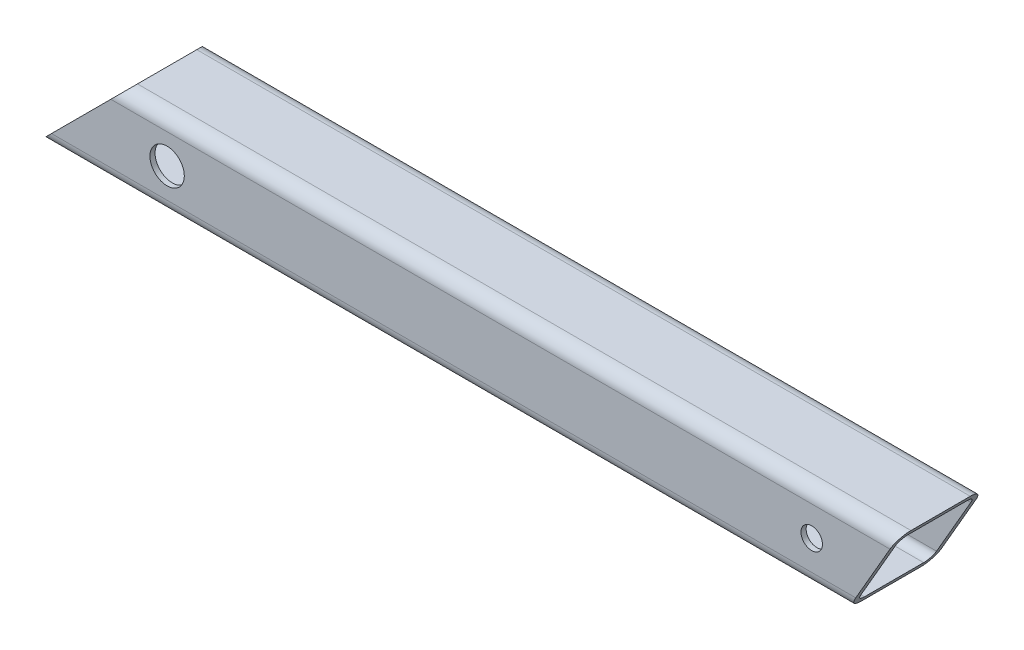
ISO-10303-21;
HEADER;
FILE_DESCRIPTION(('STEP AP214'),'2;1');
FILE_NAME('part.step','',(''),(''),'','','');
FILE_SCHEMA(('AUTOMOTIVE_DESIGN { 1 0 10303 214 1 1 1 1 }'));
ENDSEC;
DATA;
#1=APPLICATION_CONTEXT('core data for automotive mechanical design processes');
#2=APPLICATION_PROTOCOL_DEFINITION('international standard','automotive_design',2000,#1);
#3=PRODUCT_CONTEXT('',#1,'mechanical');
#4=PRODUCT('Part','Part','',(#3));
#5=PRODUCT_RELATED_PRODUCT_CATEGORY('part','',(#4));
#6=PRODUCT_DEFINITION_FORMATION('','',#4);
#7=PRODUCT_DEFINITION_CONTEXT('part definition',#1,'design');
#8=PRODUCT_DEFINITION('design','',#6,#7);
#9=PRODUCT_DEFINITION_SHAPE('','',#8);
#10=(LENGTH_UNIT() NAMED_UNIT(*) SI_UNIT(.MILLI.,.METRE.));
#11=(NAMED_UNIT(*) PLANE_ANGLE_UNIT() SI_UNIT($,.RADIAN.));
#12=(NAMED_UNIT(*) SI_UNIT($,.STERADIAN.) SOLID_ANGLE_UNIT());
#13=UNCERTAINTY_MEASURE_WITH_UNIT(LENGTH_MEASURE(1.E-05),#10,'distance_accuracy_value','');
#14=(GEOMETRIC_REPRESENTATION_CONTEXT(3) GLOBAL_UNCERTAINTY_ASSIGNED_CONTEXT((#13)) GLOBAL_UNIT_ASSIGNED_CONTEXT((#10,
#11,#12)) REPRESENTATION_CONTEXT('',''));
#15=CARTESIAN_POINT('',(0.,0.,0.));
#16=DIRECTION('',(0.,0.,1.));
#17=DIRECTION('',(1.,0.,0.));
#18=AXIS2_PLACEMENT_3D('',#15,#16,#17);
#19=CARTESIAN_POINT('',(1000.,34.5,34.4999999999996));
#20=DIRECTION('',(-1.,0.,0.));
#21=DIRECTION('',(0.,0.,1.));
#22=AXIS2_PLACEMENT_3D('',#19,#20,#21);
#23=CYLINDRICAL_SURFACE('',#22,9.5);
#24=DIRECTION('',(-1.,0.,0.));
#25=VECTOR('',#24,1.);
#26=CARTESIAN_POINT('',(1000.,44.,34.4999999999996));
#27=LINE('',#26,#25);
#28=CARTESIAN_POINT('',(996.535898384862,44.,34.5));
#29=VERTEX_POINT('',#28);
#30=CARTESIAN_POINT('',(93.9999999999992,44.,34.5));
#31=VERTEX_POINT('',#30);
#32=EDGE_CURVE('E12',#29,#31,#27,.T.);
#33=ORIENTED_EDGE('',*,*,#32,.F.);
#34=CARTESIAN_POINT('',(991.051070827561,34.5,34.4999999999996));
#35=DIRECTION('',(0.866025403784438,-0.500000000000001,0.));
#36=DIRECTION('',(-0.500000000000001,-0.866025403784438,0.));
#37=AXIS2_PLACEMENT_3D('',#34,#35,#36);
#38=ELLIPSE('',#37,10.9696551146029,9.5);
#39=CARTESIAN_POINT('',(991.051070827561,34.5,43.9999999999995));
#40=VERTEX_POINT('',#39);
#41=EDGE_CURVE('E278',#29,#40,#38,.T.);
#42=ORIENTED_EDGE('',*,*,#41,.T.);
#43=DIRECTION('',(-1.,0.,0.));
#44=VECTOR('',#43,1.);
#45=CARTESIAN_POINT('',(1000.,34.5,43.9999999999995));
#46=LINE('',#45,#44);
#47=CARTESIAN_POINT('',(84.4999999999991,34.5,44.));
#48=VERTEX_POINT('',#47);
#49=EDGE_CURVE('E214',#40,#48,#46,.T.);
#50=ORIENTED_EDGE('',*,*,#49,.T.);
#51=CARTESIAN_POINT('',(84.4999999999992,34.5,34.5));
#52=DIRECTION('',(-0.707106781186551,0.707106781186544,0.));
#53=DIRECTION('',(-0.707106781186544,-0.707106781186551,0.));
#54=AXIS2_PLACEMENT_3D('',#51,#52,#53);
#55=ELLIPSE('',#54,13.4350288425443,9.5);
#56=EDGE_CURVE('E311',#48,#31,#55,.T.);
#57=ORIENTED_EDGE('',*,*,#56,.T.);
#58=EDGE_LOOP('',(#33,#42,#50,#57));
#59=FACE_BOUND('',#58,.T.);
#60=ADVANCED_FACE('F66',(#59),#23,.F.);
#61=CARTESIAN_POINT('',(1000.,44.,34.4999999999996));
#62=DIRECTION('',(0.,-1.,0.));
#63=DIRECTION('',(0.,0.,-1.));
#64=AXIS2_PLACEMENT_3D('',#61,#62,#63);
#65=PLANE('',#64);
#66=DIRECTION('',(-1.,0.,0.));
#67=VECTOR('',#66,1.);
#68=CARTESIAN_POINT('',(1000.,44.,-34.5000000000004));
#69=LINE('',#68,#67);
#70=CARTESIAN_POINT('',(996.535898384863,44.,-34.5000000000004));
#71=VERTEX_POINT('',#70);
#72=CARTESIAN_POINT('',(93.9999999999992,44.,-34.5));
#73=VERTEX_POINT('',#72);
#74=EDGE_CURVE('E75',#71,#73,#69,.T.);
#75=ORIENTED_EDGE('',*,*,#74,.F.);
#76=DIRECTION('',(0.,0.,1.));
#77=VECTOR('',#76,1.);
#78=CARTESIAN_POINT('',(996.535898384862,44.,34.4999999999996));
#79=LINE('',#78,#77);
#80=EDGE_CURVE('E275',#71,#29,#79,.T.);
#81=ORIENTED_EDGE('',*,*,#80,.T.);
#82=ORIENTED_EDGE('',*,*,#32,.T.);
#83=DIRECTION('',(0.,0.,-1.));
#84=VECTOR('',#83,1.);
#85=CARTESIAN_POINT('',(93.9999999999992,44.,34.4999999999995));
#86=LINE('',#85,#84);
#87=EDGE_CURVE('E308',#31,#73,#86,.T.);
#88=ORIENTED_EDGE('',*,*,#87,.T.);
#89=EDGE_LOOP('',(#75,#81,#82,#88));
#90=FACE_BOUND('',#89,.T.);
#91=ADVANCED_FACE('F359',(#90),#65,.T.);
#92=CARTESIAN_POINT('',(1000.,34.5,-34.5000000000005));
#93=DIRECTION('',(-1.,0.,0.));
#94=DIRECTION('',(0.,0.,1.));
#95=AXIS2_PLACEMENT_3D('',#92,#93,#94);
#96=CYLINDRICAL_SURFACE('',#95,9.5);
#97=DIRECTION('',(-1.,0.,0.));
#98=VECTOR('',#97,1.);
#99=CARTESIAN_POINT('',(1000.,34.5,-44.0000000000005));
#100=LINE('',#99,#98);
#101=CARTESIAN_POINT('',(991.051070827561,34.5,-44.0000000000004));
#102=VERTEX_POINT('',#101);
#103=CARTESIAN_POINT('',(84.4999999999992,34.5,-44.));
#104=VERTEX_POINT('',#103);
#105=EDGE_CURVE('E224',#102,#104,#100,.T.);
#106=ORIENTED_EDGE('',*,*,#105,.F.);
#107=CARTESIAN_POINT('',(991.051070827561,34.5,-34.5000000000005));
#108=DIRECTION('',(0.866025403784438,-0.500000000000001,0.));
#109=DIRECTION('',(-0.500000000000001,-0.866025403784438,0.));
#110=AXIS2_PLACEMENT_3D('',#107,#108,#109);
#111=ELLIPSE('',#110,10.9696551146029,9.5);
#112=EDGE_CURVE('E272',#102,#71,#111,.T.);
#113=ORIENTED_EDGE('',*,*,#112,.T.);
#114=ORIENTED_EDGE('',*,*,#74,.T.);
#115=CARTESIAN_POINT('',(84.4999999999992,34.5,-34.5));
#116=DIRECTION('',(-0.707106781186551,0.707106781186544,0.));
#117=DIRECTION('',(-0.707106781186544,-0.707106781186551,0.));
#118=AXIS2_PLACEMENT_3D('',#115,#116,#117);
#119=ELLIPSE('',#118,13.4350288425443,9.5);
#120=EDGE_CURVE('E305',#73,#104,#119,.T.);
#121=ORIENTED_EDGE('',*,*,#120,.T.);
#122=EDGE_LOOP('',(#106,#113,#114,#121));
#123=FACE_BOUND('',#122,.T.);
#124=ADVANCED_FACE('F365',(#123),#96,.F.);
#125=CARTESIAN_POINT('',(1000.,34.5,-44.0000000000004));
#126=DIRECTION('',(0.,0.,1.));
#127=DIRECTION('',(1.,0.,0.));
#128=AXIS2_PLACEMENT_3D('',#125,#126,#127);
#129=PLANE('',#128);
#130=CARTESIAN_POINT('',(900.,0.,-44.0000000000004));
#131=DIRECTION('',(0.,0.,1.));
#132=DIRECTION('',(1.,0.,0.));
#133=AXIS2_PLACEMENT_3D('',#130,#131,#132);
#134=CIRCLE('',#133,12.5);
#135=CARTESIAN_POINT('',(912.5,0.,-44.0000000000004));
#136=VERTEX_POINT('',#135);
#137=EDGE_CURVE('E250',#136,#136,#134,.T.);
#138=ORIENTED_EDGE('',*,*,#137,.F.);
#139=EDGE_LOOP('',(#138));
#140=FACE_BOUND('',#139,.T.);
#141=CARTESIAN_POINT('',(150.,0.,-44.0000000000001));
#142=DIRECTION('',(0.,0.,1.));
#143=DIRECTION('',(1.,0.,0.));
#144=AXIS2_PLACEMENT_3D('',#141,#142,#143);
#145=CIRCLE('',#144,20.);
#146=CARTESIAN_POINT('',(170.,0.,-44.0000000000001));
#147=VERTEX_POINT('',#146);
#148=EDGE_CURVE('E237',#147,#147,#145,.T.);
#149=ORIENTED_EDGE('',*,*,#148,.F.);
#150=EDGE_LOOP('',(#149));
#151=FACE_BOUND('',#150,.T.);
#152=DIRECTION('',(-1.,0.,0.));
#153=VECTOR('',#152,1.);
#154=CARTESIAN_POINT('',(1000.,-34.5,-44.0000000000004));
#155=LINE('',#154,#153);
#156=CARTESIAN_POINT('',(951.213902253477,-34.5,-44.0000000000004));
#157=VERTEX_POINT('',#156);
#158=CARTESIAN_POINT('',(15.5,-34.5,-44.));
#159=VERTEX_POINT('',#158);
#160=EDGE_CURVE('E222',#157,#159,#155,.T.);
#161=ORIENTED_EDGE('',*,*,#160,.F.);
#162=DIRECTION('',(0.500000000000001,0.866025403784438,0.));
#163=VECTOR('',#162,1.);
#164=CARTESIAN_POINT('',(993.288303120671,38.375,-44.0000000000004));
#165=LINE('',#164,#163);
#166=EDGE_CURVE('E269',#157,#102,#165,.T.);
#167=ORIENTED_EDGE('',*,*,#166,.T.);
#168=ORIENTED_EDGE('',*,*,#105,.T.);
#169=DIRECTION('',(-0.707106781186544,-0.707106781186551,0.));
#170=VECTOR('',#169,1.);
#171=CARTESIAN_POINT('',(542.249999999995,492.250000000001,-44.0000000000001));
#172=LINE('',#171,#170);
#173=EDGE_CURVE('E302',#104,#159,#172,.T.);
#174=ORIENTED_EDGE('',*,*,#173,.T.);
#175=EDGE_LOOP('',(#161,#167,#168,#174));
#176=FACE_BOUND('',#175,.T.);
#177=ADVANCED_FACE('F402',(#140,#151,#176),#129,.T.);
#178=CARTESIAN_POINT('',(1000.,-34.5,-34.5000000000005));
#179=DIRECTION('',(-1.,0.,0.));
#180=DIRECTION('',(0.,0.,1.));
#181=AXIS2_PLACEMENT_3D('',#178,#179,#180);
#182=CYLINDRICAL_SURFACE('',#181,9.50000000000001);
#183=DIRECTION('',(-1.,0.,0.));
#184=VECTOR('',#183,1.);
#185=CARTESIAN_POINT('',(1000.,-44.,-34.5000000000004));
#186=LINE('',#185,#184);
#187=CARTESIAN_POINT('',(945.729074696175,-44.,-34.5000000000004));
#188=VERTEX_POINT('',#187);
#189=CARTESIAN_POINT('',(5.99999999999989,-44.,-34.5000000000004));
#190=VERTEX_POINT('',#189);
#191=EDGE_CURVE('E220',#188,#190,#186,.T.);
#192=ORIENTED_EDGE('',*,*,#191,.F.);
#193=CARTESIAN_POINT('',(951.213902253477,-34.5,-34.5000000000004));
#194=DIRECTION('',(0.866025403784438,-0.500000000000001,0.));
#195=DIRECTION('',(-0.500000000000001,-0.866025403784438,0.));
#196=AXIS2_PLACEMENT_3D('',#193,#194,#195);
#197=ELLIPSE('',#196,10.9696551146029,9.50000000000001);
#198=EDGE_CURVE('E266',#188,#157,#197,.T.);
#199=ORIENTED_EDGE('',*,*,#198,.T.);
#200=ORIENTED_EDGE('',*,*,#160,.T.);
#201=CARTESIAN_POINT('',(15.5,-34.5,-34.5));
#202=DIRECTION('',(-0.707106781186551,0.707106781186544,0.));
#203=DIRECTION('',(-0.707106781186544,-0.707106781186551,0.));
#204=AXIS2_PLACEMENT_3D('',#201,#202,#203);
#205=ELLIPSE('',#204,13.4350288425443,9.50000000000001);
#206=EDGE_CURVE('E299',#159,#190,#205,.T.);
#207=ORIENTED_EDGE('',*,*,#206,.T.);
#208=EDGE_LOOP('',(#192,#199,#200,#207));
#209=FACE_BOUND('',#208,.T.);
#210=ADVANCED_FACE('F398',(#209),#182,.F.);
#211=CARTESIAN_POINT('',(1000.,-44.,34.4999999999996));
#212=DIRECTION('',(0.,1.,0.));
#213=DIRECTION('',(0.,0.,1.));
#214=AXIS2_PLACEMENT_3D('',#211,#212,#213);
#215=PLANE('',#214);
#216=DIRECTION('',(-1.,0.,0.));
#217=VECTOR('',#216,1.);
#218=CARTESIAN_POINT('',(1000.,-44.,34.4999999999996));
#219=LINE('',#218,#217);
#220=CARTESIAN_POINT('',(945.729074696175,-44.,34.4999999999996));
#221=VERTEX_POINT('',#220);
#222=CARTESIAN_POINT('',(5.99999999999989,-44.,34.5));
#223=VERTEX_POINT('',#222);
#224=EDGE_CURVE('E218',#221,#223,#219,.T.);
#225=ORIENTED_EDGE('',*,*,#224,.F.);
#226=DIRECTION('',(0.,0.,-1.));
#227=VECTOR('',#226,1.);
#228=CARTESIAN_POINT('',(945.729074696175,-44.,34.4999999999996));
#229=LINE('',#228,#227);
#230=EDGE_CURVE('E263',#221,#188,#229,.T.);
#231=ORIENTED_EDGE('',*,*,#230,.T.);
#232=ORIENTED_EDGE('',*,*,#191,.T.);
#233=DIRECTION('',(0.,0.,1.));
#234=VECTOR('',#233,1.);
#235=CARTESIAN_POINT('',(5.99999999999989,-44.,34.4999999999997));
#236=LINE('',#235,#234);
#237=EDGE_CURVE('E296',#190,#223,#236,.T.);
#238=ORIENTED_EDGE('',*,*,#237,.T.);
#239=EDGE_LOOP('',(#225,#231,#232,#238));
#240=FACE_BOUND('',#239,.T.);
#241=ADVANCED_FACE('F394',(#240),#215,.T.);
#242=CARTESIAN_POINT('',(1000.,-34.5,34.4999999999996));
#243=DIRECTION('',(-1.,0.,0.));
#244=DIRECTION('',(0.,0.,1.));
#245=AXIS2_PLACEMENT_3D('',#242,#243,#244);
#246=CYLINDRICAL_SURFACE('',#245,9.5);
#247=DIRECTION('',(-1.,0.,0.));
#248=VECTOR('',#247,1.);
#249=CARTESIAN_POINT('',(1000.,-34.5,43.9999999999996));
#250=LINE('',#249,#248);
#251=CARTESIAN_POINT('',(951.213902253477,-34.5,43.9999999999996));
#252=VERTEX_POINT('',#251);
#253=CARTESIAN_POINT('',(15.4999999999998,-34.5,44.));
#254=VERTEX_POINT('',#253);
#255=EDGE_CURVE('E216',#252,#254,#250,.T.);
#256=ORIENTED_EDGE('',*,*,#255,.F.);
#257=CARTESIAN_POINT('',(951.213902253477,-34.5,34.4999999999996));
#258=DIRECTION('',(0.866025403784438,-0.500000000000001,0.));
#259=DIRECTION('',(-0.500000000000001,-0.866025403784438,0.));
#260=AXIS2_PLACEMENT_3D('',#257,#258,#259);
#261=ELLIPSE('',#260,10.9696551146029,9.5);
#262=EDGE_CURVE('E260',#252,#221,#261,.T.);
#263=ORIENTED_EDGE('',*,*,#262,.T.);
#264=ORIENTED_EDGE('',*,*,#224,.T.);
#265=CARTESIAN_POINT('',(15.5,-34.5,34.5));
#266=DIRECTION('',(-0.707106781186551,0.707106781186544,0.));
#267=DIRECTION('',(-0.707106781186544,-0.707106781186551,0.));
#268=AXIS2_PLACEMENT_3D('',#265,#266,#267);
#269=ELLIPSE('',#268,13.4350288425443,9.5);
#270=EDGE_CURVE('E293',#223,#254,#269,.T.);
#271=ORIENTED_EDGE('',*,*,#270,.T.);
#272=EDGE_LOOP('',(#256,#263,#264,#271));
#273=FACE_BOUND('',#272,.T.);
#274=ADVANCED_FACE('F391',(#273),#246,.F.);
#275=CARTESIAN_POINT('',(1000.,34.5,-34.5000000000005));
#276=DIRECTION('',(-1.,0.,0.));
#277=DIRECTION('',(0.,0.,1.));
#278=AXIS2_PLACEMENT_3D('',#275,#276,#277);
#279=CYLINDRICAL_SURFACE('',#278,15.5);
#280=CARTESIAN_POINT('',(991.051070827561,34.5,-34.5000000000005));
#281=DIRECTION('',(0.866025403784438,-0.500000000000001,0.));
#282=DIRECTION('',(-0.500000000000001,-0.866025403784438,0.));
#283=AXIS2_PLACEMENT_3D('',#280,#281,#282);
#284=ELLIPSE('',#283,17.8978583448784,15.5);
#285=CARTESIAN_POINT('',(991.051070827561,34.5,-50.0000000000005));
#286=VERTEX_POINT('',#285);
#287=CARTESIAN_POINT('',(1000.,50.,-34.5000000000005));
#288=VERTEX_POINT('',#287);
#289=EDGE_CURVE('E202',#286,#288,#284,.T.);
#290=ORIENTED_EDGE('',*,*,#289,.F.);
#291=DIRECTION('',(-1.,0.,0.));
#292=VECTOR('',#291,1.);
#293=CARTESIAN_POINT('',(1000.,34.5,-50.0000000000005));
#294=LINE('',#293,#292);
#295=CARTESIAN_POINT('',(84.4999999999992,34.5,-50.0000000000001));
#296=VERTEX_POINT('',#295);
#297=EDGE_CURVE('E203',#286,#296,#294,.T.);
#298=ORIENTED_EDGE('',*,*,#297,.T.);
#299=CARTESIAN_POINT('',(84.4999999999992,34.5,-34.5));
#300=DIRECTION('',(-0.707106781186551,0.707106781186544,0.));
#301=DIRECTION('',(-0.707106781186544,-0.707106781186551,0.));
#302=AXIS2_PLACEMENT_3D('',#299,#300,#301);
#303=ELLIPSE('',#302,21.9203102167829,15.5);
#304=CARTESIAN_POINT('',(99.999999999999,50.,-34.5000000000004));
#305=VERTEX_POINT('',#304);
#306=EDGE_CURVE('E320',#305,#296,#303,.T.);
#307=ORIENTED_EDGE('',*,*,#306,.F.);
#308=DIRECTION('',(-1.,0.,0.));
#309=VECTOR('',#308,1.);
#310=CARTESIAN_POINT('',(1000.,50.,-34.5000000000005));
#311=LINE('',#310,#309);
#312=EDGE_CURVE('E191',#288,#305,#311,.T.);
#313=ORIENTED_EDGE('',*,*,#312,.F.);
#314=EDGE_LOOP('',(#290,#298,#307,#313));
#315=FACE_BOUND('',#314,.T.);
#316=ADVANCED_FACE('F68',(#315),#279,.T.);
#317=CARTESIAN_POINT('',(1000.,34.5,34.4999999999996));
#318=DIRECTION('',(-1.,0.,0.));
#319=DIRECTION('',(0.,0.,1.));
#320=AXIS2_PLACEMENT_3D('',#317,#318,#319);
#321=CYLINDRICAL_SURFACE('',#320,15.5);
#322=CARTESIAN_POINT('',(991.051070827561,34.5,34.4999999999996));
#323=DIRECTION('',(0.866025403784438,-0.500000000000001,0.));
#324=DIRECTION('',(-0.500000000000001,-0.866025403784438,0.));
#325=AXIS2_PLACEMENT_3D('',#322,#323,#324);
#326=ELLIPSE('',#325,17.8978583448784,15.5);
#327=CARTESIAN_POINT('',(1000.,50.,34.4999999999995));
#328=VERTEX_POINT('',#327);
#329=CARTESIAN_POINT('',(991.051070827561,34.5,49.9999999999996));
#330=VERTEX_POINT('',#329);
#331=EDGE_CURVE('E195',#328,#330,#326,.T.);
#332=ORIENTED_EDGE('',*,*,#331,.F.);
#333=DIRECTION('',(-1.,0.,0.));
#334=VECTOR('',#333,1.);
#335=CARTESIAN_POINT('',(1000.,50.,34.4999999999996));
#336=LINE('',#335,#334);
#337=CARTESIAN_POINT('',(99.9999999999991,50.,34.5));
#338=VERTEX_POINT('',#337);
#339=EDGE_CURVE('E181',#328,#338,#336,.T.);
#340=ORIENTED_EDGE('',*,*,#339,.T.);
#341=CARTESIAN_POINT('',(84.4999999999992,34.5,34.5));
#342=DIRECTION('',(-0.707106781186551,0.707106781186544,0.));
#343=DIRECTION('',(-0.707106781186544,-0.707106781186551,0.));
#344=AXIS2_PLACEMENT_3D('',#341,#342,#343);
#345=ELLIPSE('',#344,21.9203102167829,15.5);
#346=CARTESIAN_POINT('',(84.4999999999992,34.5,50.));
#347=VERTEX_POINT('',#346);
#348=EDGE_CURVE('E209',#347,#338,#345,.T.);
#349=ORIENTED_EDGE('',*,*,#348,.F.);
#350=DIRECTION('',(-1.,0.,0.));
#351=VECTOR('',#350,1.);
#352=CARTESIAN_POINT('',(1000.,34.5,49.9999999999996));
#353=LINE('',#352,#351);
#354=EDGE_CURVE('E192',#330,#347,#353,.T.);
#355=ORIENTED_EDGE('',*,*,#354,.F.);
#356=EDGE_LOOP('',(#332,#340,#349,#355));
#357=FACE_BOUND('',#356,.T.);
#358=ADVANCED_FACE('F196',(#357),#321,.T.);
#359=CARTESIAN_POINT('',(1000.,34.5,49.9999999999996));
#360=DIRECTION('',(0.,0.,-1.));
#361=DIRECTION('',(-1.,0.,0.));
#362=AXIS2_PLACEMENT_3D('',#359,#360,#361);
#363=PLANE('',#362);
#364=CARTESIAN_POINT('',(900.,0.,50.));
#365=DIRECTION('',(0.,0.,1.));
#366=DIRECTION('',(1.,0.,0.));
#367=AXIS2_PLACEMENT_3D('',#364,#365,#366);
#368=CIRCLE('',#367,12.5);
#369=CARTESIAN_POINT('',(912.5,0.,50.));
#370=VERTEX_POINT('',#369);
#371=EDGE_CURVE('E451',#370,#370,#368,.T.);
#372=ORIENTED_EDGE('',*,*,#371,.F.);
#373=EDGE_LOOP('',(#372));
#374=FACE_BOUND('',#373,.T.);
#375=CARTESIAN_POINT('',(150.,0.,50.));
#376=DIRECTION('',(0.,0.,1.));
#377=DIRECTION('',(1.,0.,0.));
#378=AXIS2_PLACEMENT_3D('',#375,#376,#377);
#379=CIRCLE('',#378,20.);
#380=CARTESIAN_POINT('',(170.,0.,50.));
#381=VERTEX_POINT('',#380);
#382=EDGE_CURVE('E245',#381,#381,#379,.T.);
#383=ORIENTED_EDGE('',*,*,#382,.F.);
#384=EDGE_LOOP('',(#383));
#385=FACE_BOUND('',#384,.T.);
#386=DIRECTION('',(-0.500000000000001,-0.866025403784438,0.));
#387=VECTOR('',#386,1.);
#388=CARTESIAN_POINT('',(993.288303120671,38.375,49.9999999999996));
#389=LINE('',#388,#387);
#390=CARTESIAN_POINT('',(951.213902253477,-34.5,49.9999999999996));
#391=VERTEX_POINT('',#390);
#392=EDGE_CURVE('E83',#330,#391,#389,.T.);
#393=ORIENTED_EDGE('',*,*,#392,.F.);
#394=ORIENTED_EDGE('',*,*,#354,.T.);
#395=DIRECTION('',(0.707106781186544,0.707106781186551,0.));
#396=VECTOR('',#395,1.);
#397=CARTESIAN_POINT('',(542.249999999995,492.25,49.9999999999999));
#398=LINE('',#397,#396);
#399=CARTESIAN_POINT('',(15.5,-34.5,50.));
#400=VERTEX_POINT('',#399);
#401=EDGE_CURVE('E325',#400,#347,#398,.T.);
#402=ORIENTED_EDGE('',*,*,#401,.F.);
#403=DIRECTION('',(-1.,0.,0.));
#404=VECTOR('',#403,1.);
#405=CARTESIAN_POINT('',(1000.,-34.5,49.9999999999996));
#406=LINE('',#405,#404);
#407=EDGE_CURVE('E232',#391,#400,#406,.T.);
#408=ORIENTED_EDGE('',*,*,#407,.F.);
#409=EDGE_LOOP('',(#393,#394,#402,#408));
#410=FACE_BOUND('',#409,.T.);
#411=ADVANCED_FACE('F346',(#374,#385,#410),#363,.F.);
#412=CARTESIAN_POINT('',(1000.,-34.5,34.4999999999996));
#413=DIRECTION('',(-1.,0.,0.));
#414=DIRECTION('',(0.,0.,1.));
#415=AXIS2_PLACEMENT_3D('',#412,#413,#414);
#416=CYLINDRICAL_SURFACE('',#415,15.5);
#417=CARTESIAN_POINT('',(951.213902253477,-34.5,34.4999999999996));
#418=DIRECTION('',(0.866025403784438,-0.500000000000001,0.));
#419=DIRECTION('',(-0.500000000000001,-0.866025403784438,0.));
#420=AXIS2_PLACEMENT_3D('',#417,#418,#419);
#421=ELLIPSE('',#420,17.8978583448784,15.5);
#422=CARTESIAN_POINT('',(942.264973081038,-50.,34.4999999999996));
#423=VERTEX_POINT('',#422);
#424=EDGE_CURVE('E91',#391,#423,#421,.T.);
#425=ORIENTED_EDGE('',*,*,#424,.F.);
#426=ORIENTED_EDGE('',*,*,#407,.T.);
#427=CARTESIAN_POINT('',(15.5,-34.5,34.5));
#428=DIRECTION('',(-0.707106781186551,0.707106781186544,0.));
#429=DIRECTION('',(-0.707106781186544,-0.707106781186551,0.));
#430=AXIS2_PLACEMENT_3D('',#427,#428,#429);
#431=ELLIPSE('',#430,21.9203102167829,15.5);
#432=CARTESIAN_POINT('',(0.,-50.,34.5));
#433=VERTEX_POINT('',#432);
#434=EDGE_CURVE('E323',#433,#400,#431,.T.);
#435=ORIENTED_EDGE('',*,*,#434,.F.);
#436=DIRECTION('',(-1.,0.,0.));
#437=VECTOR('',#436,1.);
#438=CARTESIAN_POINT('',(1000.,-50.,34.4999999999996));
#439=LINE('',#438,#437);
#440=EDGE_CURVE('E230',#423,#433,#439,.T.);
#441=ORIENTED_EDGE('',*,*,#440,.F.);
#442=EDGE_LOOP('',(#425,#426,#435,#441));
#443=FACE_BOUND('',#442,.T.);
#444=ADVANCED_FACE('F345',(#443),#416,.T.);
#445=CARTESIAN_POINT('',(1000.,-34.5,-34.5000000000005));
#446=DIRECTION('',(-1.,0.,0.));
#447=DIRECTION('',(0.,0.,1.));
#448=AXIS2_PLACEMENT_3D('',#445,#446,#447);
#449=CYLINDRICAL_SURFACE('',#448,15.5);
#450=CARTESIAN_POINT('',(951.213902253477,-34.5,-34.5000000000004));
#451=DIRECTION('',(0.866025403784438,-0.500000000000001,0.));
#452=DIRECTION('',(-0.500000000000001,-0.866025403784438,0.));
#453=AXIS2_PLACEMENT_3D('',#450,#451,#452);
#454=ELLIPSE('',#453,17.8978583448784,15.5);
#455=CARTESIAN_POINT('',(942.264973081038,-50.,-34.5000000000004));
#456=VERTEX_POINT('',#455);
#457=CARTESIAN_POINT('',(951.213902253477,-34.5,-50.0000000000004));
#458=VERTEX_POINT('',#457);
#459=EDGE_CURVE('E283',#456,#458,#454,.T.);
#460=ORIENTED_EDGE('',*,*,#459,.F.);
#461=DIRECTION('',(-1.,0.,0.));
#462=VECTOR('',#461,1.);
#463=CARTESIAN_POINT('',(1000.,-50.,-34.5000000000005));
#464=LINE('',#463,#462);
#465=CARTESIAN_POINT('',(0.,-50.,-34.5));
#466=VERTEX_POINT('',#465);
#467=EDGE_CURVE('E228',#456,#466,#464,.T.);
#468=ORIENTED_EDGE('',*,*,#467,.T.);
#469=CARTESIAN_POINT('',(15.5,-34.5,-34.5));
#470=DIRECTION('',(-0.707106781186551,0.707106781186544,0.));
#471=DIRECTION('',(-0.707106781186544,-0.707106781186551,0.));
#472=AXIS2_PLACEMENT_3D('',#469,#470,#471);
#473=ELLIPSE('',#472,21.9203102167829,15.5);
#474=CARTESIAN_POINT('',(15.5,-34.5,-50.));
#475=VERTEX_POINT('',#474);
#476=EDGE_CURVE('E317',#475,#466,#473,.T.);
#477=ORIENTED_EDGE('',*,*,#476,.F.);
#478=DIRECTION('',(-1.,0.,0.));
#479=VECTOR('',#478,1.);
#480=CARTESIAN_POINT('',(1000.,-34.5,-50.0000000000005));
#481=LINE('',#480,#479);
#482=EDGE_CURVE('E206',#458,#475,#481,.T.);
#483=ORIENTED_EDGE('',*,*,#482,.F.);
#484=EDGE_LOOP('',(#460,#468,#477,#483));
#485=FACE_BOUND('',#484,.T.);
#486=ADVANCED_FACE('F339',(#485),#449,.T.);
#487=CARTESIAN_POINT('',(1000.,34.5,-50.0000000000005));
#488=DIRECTION('',(0.,0.,1.));
#489=DIRECTION('',(1.,0.,0.));
#490=AXIS2_PLACEMENT_3D('',#487,#488,#489);
#491=PLANE('',#490);
#492=CARTESIAN_POINT('',(900.,0.,-50.0000000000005));
#493=DIRECTION('',(0.,0.,1.));
#494=DIRECTION('',(1.,0.,0.));
#495=AXIS2_PLACEMENT_3D('',#492,#493,#494);
#496=CIRCLE('',#495,12.5);
#497=CARTESIAN_POINT('',(912.5,0.,-50.0000000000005));
#498=VERTEX_POINT('',#497);
#499=EDGE_CURVE('E452',#498,#498,#496,.T.);
#500=ORIENTED_EDGE('',*,*,#499,.T.);
#501=EDGE_LOOP('',(#500));
#502=FACE_BOUND('',#501,.T.);
#503=CARTESIAN_POINT('',(150.,0.,-50.0000000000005));
#504=DIRECTION('',(0.,0.,1.));
#505=DIRECTION('',(1.,0.,0.));
#506=AXIS2_PLACEMENT_3D('',#503,#504,#505);
#507=CIRCLE('',#506,20.);
#508=CARTESIAN_POINT('',(170.,0.,-50.0000000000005));
#509=VERTEX_POINT('',#508);
#510=EDGE_CURVE('E238',#509,#509,#507,.T.);
#511=ORIENTED_EDGE('',*,*,#510,.T.);
#512=EDGE_LOOP('',(#511));
#513=FACE_BOUND('',#512,.T.);
#514=DIRECTION('',(0.500000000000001,0.866025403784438,0.));
#515=VECTOR('',#514,1.);
#516=CARTESIAN_POINT('',(993.288303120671,38.375,-50.0000000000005));
#517=LINE('',#516,#515);
#518=EDGE_CURVE('E281',#458,#286,#517,.T.);
#519=ORIENTED_EDGE('',*,*,#518,.F.);
#520=ORIENTED_EDGE('',*,*,#482,.T.);
#521=DIRECTION('',(-0.707106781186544,-0.707106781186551,0.));
#522=VECTOR('',#521,1.);
#523=CARTESIAN_POINT('',(542.249999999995,492.25,-50.0000000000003));
#524=LINE('',#523,#522);
#525=EDGE_CURVE('E314',#296,#475,#524,.T.);
#526=ORIENTED_EDGE('',*,*,#525,.F.);
#527=ORIENTED_EDGE('',*,*,#297,.F.);
#528=EDGE_LOOP('',(#519,#520,#526,#527));
#529=FACE_BOUND('',#528,.T.);
#530=ADVANCED_FACE('F335',(#502,#513,#529),#491,.F.);
#531=CARTESIAN_POINT('',(1000.,34.5,43.9999999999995));
#532=DIRECTION('',(0.,0.,-1.));
#533=DIRECTION('',(-1.,0.,0.));
#534=AXIS2_PLACEMENT_3D('',#531,#532,#533);
#535=PLANE('',#534);
#536=CARTESIAN_POINT('',(900.,0.,43.9999999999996));
#537=DIRECTION('',(0.,0.,-1.));
#538=DIRECTION('',(-1.,0.,0.));
#539=AXIS2_PLACEMENT_3D('',#536,#537,#538);
#540=CIRCLE('',#539,12.5);
#541=CARTESIAN_POINT('',(887.5,0.,43.9999999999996));
#542=VERTEX_POINT('',#541);
#543=EDGE_CURVE('E70',#542,#542,#540,.T.);
#544=ORIENTED_EDGE('',*,*,#543,.F.);
#545=EDGE_LOOP('',(#544));
#546=FACE_BOUND('',#545,.T.);
#547=CARTESIAN_POINT('',(150.,0.,43.9999999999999));
#548=DIRECTION('',(0.,0.,-1.));
#549=DIRECTION('',(-1.,0.,0.));
#550=AXIS2_PLACEMENT_3D('',#547,#548,#549);
#551=CIRCLE('',#550,20.);
#552=CARTESIAN_POINT('',(130.,0.,43.9999999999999));
#553=VERTEX_POINT('',#552);
#554=EDGE_CURVE('E235',#553,#553,#551,.T.);
#555=ORIENTED_EDGE('',*,*,#554,.F.);
#556=EDGE_LOOP('',(#555));
#557=FACE_BOUND('',#556,.T.);
#558=ORIENTED_EDGE('',*,*,#49,.F.);
#559=DIRECTION('',(-0.500000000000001,-0.866025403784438,0.));
#560=VECTOR('',#559,1.);
#561=CARTESIAN_POINT('',(993.288303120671,38.375,43.9999999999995));
#562=LINE('',#561,#560);
#563=EDGE_CURVE('E257',#40,#252,#562,.T.);
#564=ORIENTED_EDGE('',*,*,#563,.T.);
#565=ORIENTED_EDGE('',*,*,#255,.T.);
#566=DIRECTION('',(0.707106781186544,0.707106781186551,0.));
#567=VECTOR('',#566,1.);
#568=CARTESIAN_POINT('',(542.249999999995,492.250000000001,43.9999999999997));
#569=LINE('',#568,#567);
#570=EDGE_CURVE('E290',#254,#48,#569,.T.);
#571=ORIENTED_EDGE('',*,*,#570,.T.);
#572=EDGE_LOOP('',(#558,#564,#565,#571));
#573=FACE_BOUND('',#572,.T.);
#574=ADVANCED_FACE('F373',(#546,#557,#573),#535,.T.);
#575=CARTESIAN_POINT('',(1000.,-50.,34.4999999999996));
#576=DIRECTION('',(0.,1.,0.));
#577=DIRECTION('',(0.,0.,1.));
#578=AXIS2_PLACEMENT_3D('',#575,#576,#577);
#579=PLANE('',#578);
#580=DIRECTION('',(0.,0.,-1.));
#581=VECTOR('',#580,1.);
#582=CARTESIAN_POINT('',(942.264973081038,-50.,1317.43811729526));
#583=LINE('',#582,#581);
#584=EDGE_CURVE('E242',#423,#456,#583,.T.);
#585=ORIENTED_EDGE('',*,*,#584,.F.);
#586=ORIENTED_EDGE('',*,*,#440,.T.);
#587=DIRECTION('',(0.,0.,-1.));
#588=VECTOR('',#587,1.);
#589=CARTESIAN_POINT('',(0.,-50.,34.5));
#590=LINE('',#589,#588);
#591=EDGE_CURVE('E204',#433,#466,#590,.T.);
#592=ORIENTED_EDGE('',*,*,#591,.T.);
#593=ORIENTED_EDGE('',*,*,#467,.F.);
#594=EDGE_LOOP('',(#585,#586,#592,#593));
#595=FACE_BOUND('',#594,.T.);
#596=ADVANCED_FACE('F342',(#595),#579,.F.);
#597=CARTESIAN_POINT('',(1000.,50.,34.4999999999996));
#598=DIRECTION('',(0.,-1.,0.));
#599=DIRECTION('',(0.,0.,-1.));
#600=AXIS2_PLACEMENT_3D('',#597,#598,#599);
#601=PLANE('',#600);
#602=DIRECTION('',(0.,0.,-1.));
#603=VECTOR('',#602,1.);
#604=CARTESIAN_POINT('',(99.999999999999,50.,1305.56311729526));
#605=LINE('',#604,#603);
#606=EDGE_CURVE('E188',#338,#305,#605,.T.);
#607=ORIENTED_EDGE('',*,*,#606,.F.);
#608=ORIENTED_EDGE('',*,*,#339,.F.);
#609=DIRECTION('',(0.,0.,1.));
#610=VECTOR('',#609,1.);
#611=CARTESIAN_POINT('',(1000.,50.,34.4999999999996));
#612=LINE('',#611,#610);
#613=EDGE_CURVE('E186',#288,#328,#612,.T.);
#614=ORIENTED_EDGE('',*,*,#613,.F.);
#615=ORIENTED_EDGE('',*,*,#312,.T.);
#616=EDGE_LOOP('',(#607,#608,#614,#615));
#617=FACE_BOUND('',#616,.T.);
#618=ADVANCED_FACE('F183',(#617),#601,.F.);
#619=CARTESIAN_POINT('',(0.,-50.,1305.56311729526));
#620=DIRECTION('',(-0.707106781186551,0.707106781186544,0.));
#621=DIRECTION('',(-0.707106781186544,-0.707106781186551,0.));
#622=AXIS2_PLACEMENT_3D('',#619,#620,#621);
#623=PLANE('',#622);
#624=ORIENTED_EDGE('',*,*,#56,.F.);
#625=ORIENTED_EDGE('',*,*,#570,.F.);
#626=ORIENTED_EDGE('',*,*,#270,.F.);
#627=ORIENTED_EDGE('',*,*,#237,.F.);
#628=ORIENTED_EDGE('',*,*,#206,.F.);
#629=ORIENTED_EDGE('',*,*,#173,.F.);
#630=ORIENTED_EDGE('',*,*,#120,.F.);
#631=ORIENTED_EDGE('',*,*,#87,.F.);
#632=EDGE_LOOP('',(#624,#625,#626,#627,#628,#629,#630,#631));
#633=FACE_BOUND('',#632,.T.);
#634=ORIENTED_EDGE('',*,*,#401,.T.);
#635=ORIENTED_EDGE('',*,*,#348,.T.);
#636=ORIENTED_EDGE('',*,*,#606,.T.);
#637=ORIENTED_EDGE('',*,*,#306,.T.);
#638=ORIENTED_EDGE('',*,*,#525,.T.);
#639=ORIENTED_EDGE('',*,*,#476,.T.);
#640=ORIENTED_EDGE('',*,*,#591,.F.);
#641=ORIENTED_EDGE('',*,*,#434,.T.);
#642=EDGE_LOOP('',(#634,#635,#636,#637,#638,#639,#640,#641));
#643=FACE_BOUND('',#642,.T.);
#644=ADVANCED_FACE('F329',(#633,#643),#623,.T.);
#645=CARTESIAN_POINT('',(1000.,50.,1317.43811729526));
#646=DIRECTION('',(0.866025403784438,-0.500000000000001,0.));
#647=DIRECTION('',(0.500000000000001,0.866025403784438,0.));
#648=AXIS2_PLACEMENT_3D('',#645,#646,#647);
#649=PLANE('',#648);
#650=ORIENTED_EDGE('',*,*,#41,.F.);
#651=ORIENTED_EDGE('',*,*,#80,.F.);
#652=ORIENTED_EDGE('',*,*,#112,.F.);
#653=ORIENTED_EDGE('',*,*,#166,.F.);
#654=ORIENTED_EDGE('',*,*,#198,.F.);
#655=ORIENTED_EDGE('',*,*,#230,.F.);
#656=ORIENTED_EDGE('',*,*,#262,.F.);
#657=ORIENTED_EDGE('',*,*,#563,.F.);
#658=EDGE_LOOP('',(#650,#651,#652,#653,#654,#655,#656,#657));
#659=FACE_BOUND('',#658,.T.);
#660=ORIENTED_EDGE('',*,*,#613,.T.);
#661=ORIENTED_EDGE('',*,*,#331,.T.);
#662=ORIENTED_EDGE('',*,*,#392,.T.);
#663=ORIENTED_EDGE('',*,*,#424,.T.);
#664=ORIENTED_EDGE('',*,*,#584,.T.);
#665=ORIENTED_EDGE('',*,*,#459,.T.);
#666=ORIENTED_EDGE('',*,*,#518,.T.);
#667=ORIENTED_EDGE('',*,*,#289,.T.);
#668=EDGE_LOOP('',(#660,#661,#662,#663,#664,#665,#666,#667));
#669=FACE_BOUND('',#668,.T.);
#670=ADVANCED_FACE('F200',(#659,#669),#649,.T.);
#671=CARTESIAN_POINT('',(150.,0.,-50.0000000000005));
#672=DIRECTION('',(0.,0.,1.));
#673=DIRECTION('',(1.,0.,0.));
#674=AXIS2_PLACEMENT_3D('',#671,#672,#673);
#675=CYLINDRICAL_SURFACE('',#674,20.);
#676=ORIENTED_EDGE('',*,*,#554,.T.);
#677=EDGE_LOOP('',(#676));
#678=FACE_BOUND('',#677,.T.);
#679=ORIENTED_EDGE('',*,*,#382,.T.);
#680=EDGE_LOOP('',(#679));
#681=FACE_BOUND('',#680,.T.);
#682=ADVANCED_FACE('F430',(#678,#681),#675,.F.);
#683=ORIENTED_EDGE('',*,*,#148,.T.);
#684=EDGE_LOOP('',(#683));
#685=FACE_BOUND('',#684,.T.);
#686=ORIENTED_EDGE('',*,*,#510,.F.);
#687=EDGE_LOOP('',(#686));
#688=FACE_BOUND('',#687,.T.);
#689=ADVANCED_FACE('F435',(#685,#688),#675,.F.);
#690=CARTESIAN_POINT('',(900.,0.,-50.0000000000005));
#691=DIRECTION('',(0.,0.,1.));
#692=DIRECTION('',(1.,0.,0.));
#693=AXIS2_PLACEMENT_3D('',#690,#691,#692);
#694=CYLINDRICAL_SURFACE('',#693,12.5);
#695=ORIENTED_EDGE('',*,*,#543,.T.);
#696=EDGE_LOOP('',(#695));
#697=FACE_BOUND('',#696,.T.);
#698=ORIENTED_EDGE('',*,*,#371,.T.);
#699=EDGE_LOOP('',(#698));
#700=FACE_BOUND('',#699,.T.);
#701=ADVANCED_FACE('F438',(#697,#700),#694,.F.);
#702=ORIENTED_EDGE('',*,*,#137,.T.);
#703=EDGE_LOOP('',(#702));
#704=FACE_BOUND('',#703,.T.);
#705=ORIENTED_EDGE('',*,*,#499,.F.);
#706=EDGE_LOOP('',(#705));
#707=FACE_BOUND('',#706,.T.);
#708=ADVANCED_FACE('F440',(#704,#707),#694,.F.);
#709=CLOSED_SHELL('',(#60,#91,#124,#177,#210,#241,#274,#316,#358,#411,#444,#486,#530,#574,#596,
#618,#644,#670,#682,#689,#701,#708));
#710=MANIFOLD_SOLID_BREP('B2',#709);
#711=ADVANCED_BREP_SHAPE_REPRESENTATION('',(#18,#710),#14);
#712=SHAPE_DEFINITION_REPRESENTATION(#9,#711);
ENDSEC;
END-ISO-10303-21;
